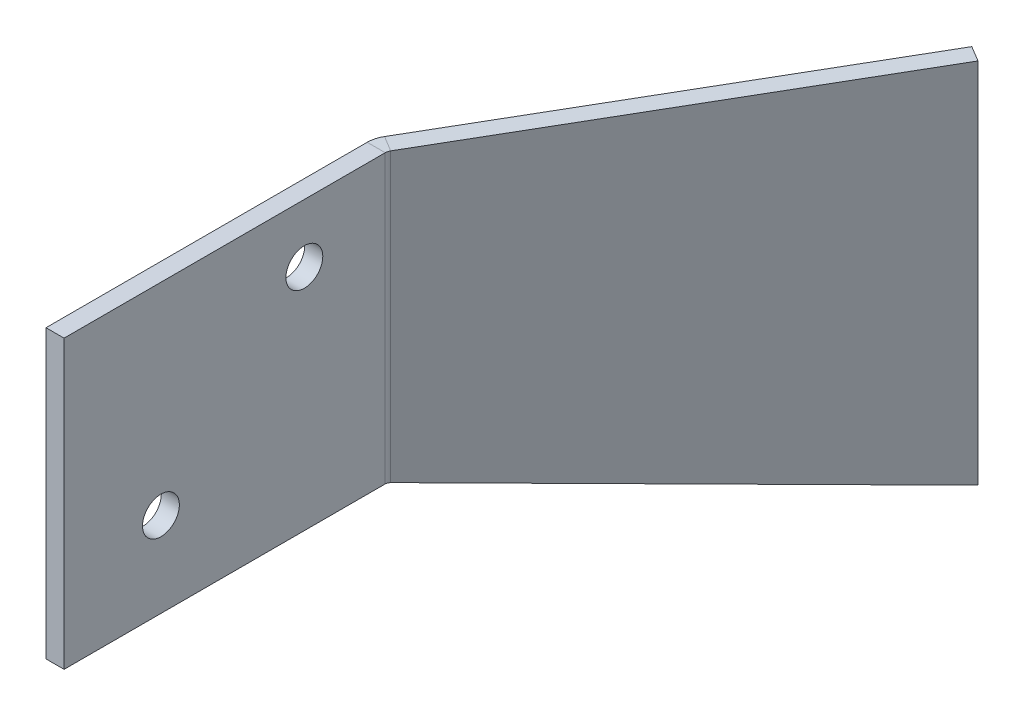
ISO-10303-21;
HEADER;
FILE_DESCRIPTION(('STEP AP214'),'2;1');
FILE_NAME('part.step','',(''),(''),'','','');
FILE_SCHEMA(('AUTOMOTIVE_DESIGN { 1 0 10303 214 1 1 1 1 }'));
ENDSEC;
DATA;
#1=APPLICATION_CONTEXT('core data for automotive mechanical design processes');
#2=APPLICATION_PROTOCOL_DEFINITION('international standard','automotive_design',2000,#1);
#3=PRODUCT_CONTEXT('',#1,'mechanical');
#4=PRODUCT('Part','Part','',(#3));
#5=PRODUCT_RELATED_PRODUCT_CATEGORY('part','',(#4));
#6=PRODUCT_DEFINITION_FORMATION('','',#4);
#7=PRODUCT_DEFINITION_CONTEXT('part definition',#1,'design');
#8=PRODUCT_DEFINITION('design','',#6,#7);
#9=PRODUCT_DEFINITION_SHAPE('','',#8);
#10=(LENGTH_UNIT() NAMED_UNIT(*) SI_UNIT(.MILLI.,.METRE.));
#11=(NAMED_UNIT(*) PLANE_ANGLE_UNIT() SI_UNIT($,.RADIAN.));
#12=(NAMED_UNIT(*) SI_UNIT($,.STERADIAN.) SOLID_ANGLE_UNIT());
#13=UNCERTAINTY_MEASURE_WITH_UNIT(LENGTH_MEASURE(1.E-05),#10,'distance_accuracy_value','');
#14=(GEOMETRIC_REPRESENTATION_CONTEXT(3) GLOBAL_UNCERTAINTY_ASSIGNED_CONTEXT((#13)) GLOBAL_UNIT_ASSIGNED_CONTEXT((#10,
#11,#12)) REPRESENTATION_CONTEXT('',''));
#15=CARTESIAN_POINT('',(0.,0.,0.));
#16=DIRECTION('',(0.,0.,1.));
#17=DIRECTION('',(1.,0.,0.));
#18=AXIS2_PLACEMENT_3D('',#15,#16,#17);
#19=CARTESIAN_POINT('',(-1.6002,-19.396714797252,15.875));
#20=DIRECTION('',(0.,0.,1.));
#21=DIRECTION('',(-1.,0.,0.));
#22=AXIS2_PLACEMENT_3D('',#19,#20,#21);
#23=PLANE('',#22);
#24=DIRECTION('',(0.,1.,0.));
#25=VECTOR('',#24,1.);
#26=CARTESIAN_POINT('',(-1.6002,-19.396714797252,15.875));
#27=LINE('',#26,#25);
#28=CARTESIAN_POINT('',(-1.6002,-19.396714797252,15.875));
#29=VERTEX_POINT('',#28);
#30=CARTESIAN_POINT('',(-1.6002,6.00328520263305,15.875));
#31=VERTEX_POINT('',#30);
#32=EDGE_CURVE('E197',#29,#31,#27,.T.);
#33=ORIENTED_EDGE('',*,*,#32,.F.);
#34=DIRECTION('',(1.,0.,0.));
#35=VECTOR('',#34,1.);
#36=CARTESIAN_POINT('',(-1.6002,-19.396714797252,15.875));
#37=LINE('',#36,#35);
#38=CARTESIAN_POINT('',(0.,-19.396714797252,15.875));
#39=VERTEX_POINT('',#38);
#40=EDGE_CURVE('E11',#29,#39,#37,.T.);
#41=ORIENTED_EDGE('',*,*,#40,.T.);
#42=DIRECTION('',(0.,1.,0.));
#43=VECTOR('',#42,1.);
#44=CARTESIAN_POINT('',(0.,-19.396714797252,15.875));
#45=LINE('',#44,#43);
#46=CARTESIAN_POINT('',(0.,6.00328520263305,15.875));
#47=VERTEX_POINT('',#46);
#48=EDGE_CURVE('E205',#39,#47,#45,.T.);
#49=ORIENTED_EDGE('',*,*,#48,.T.);
#50=DIRECTION('',(1.,0.,0.));
#51=VECTOR('',#50,1.);
#52=CARTESIAN_POINT('',(0.,6.00328520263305,15.875));
#53=LINE('',#52,#51);
#54=EDGE_CURVE('E200',#47,#31,#53,.F.);
#55=ORIENTED_EDGE('',*,*,#54,.T.);
#56=EDGE_LOOP('',(#33,#41,#49,#55));
#57=FACE_BOUND('',#56,.T.);
#58=ADVANCED_FACE('F41',(#57),#23,.T.);
#59=CARTESIAN_POINT('',(0.73660000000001,-19.4327343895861,-12.5637679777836));
#60=DIRECTION('',(0.,-1.,0.));
#61=DIRECTION('',(-0.857167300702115,0.,-0.515038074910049));
#62=AXIS2_PLACEMENT_3D('',#59,#60,#61);
#63=CYLINDRICAL_SURFACE('',#62,2.33679999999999);
#64=DIRECTION('',(0.,-1.,0.));
#65=VECTOR('',#64,1.);
#66=CARTESIAN_POINT('',(-1.26642854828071,19.396714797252,-13.7673089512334));
#67=LINE('',#66,#65);
#68=CARTESIAN_POINT('',(-1.2664285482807,-19.4327343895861,-13.7673089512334));
#69=VERTEX_POINT('',#68);
#70=CARTESIAN_POINT('',(-1.26642854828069,6.00810081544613,-13.7673089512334));
#71=VERTEX_POINT('',#70);
#72=EDGE_CURVE('E127',#69,#71,#67,.F.);
#73=ORIENTED_EDGE('',*,*,#72,.F.);
#74=CARTESIAN_POINT('',(-1.26642854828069,-19.4327343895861,-13.7673089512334));
#75=CARTESIAN_POINT('',(-1.27999492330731,-19.4319839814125,-13.7447310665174));
#76=CARTESIAN_POINT('',(-1.29317923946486,-19.4312335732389,-13.7219236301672));
#77=CARTESIAN_POINT('',(-1.31876938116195,-19.4297327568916,-13.6758761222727));
#78=CARTESIAN_POINT('',(-1.3311752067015,-19.428982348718,-13.6526360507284));
#79=CARTESIAN_POINT('',(-1.35519399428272,-19.4274815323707,-13.6057497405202));
#80=CARTESIAN_POINT('',(-1.3668069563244,-19.4267311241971,-13.5821035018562));
#81=CARTESIAN_POINT('',(-1.38922678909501,-19.4252303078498,-13.5344319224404));
#82=CARTESIAN_POINT('',(-1.40003365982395,-19.4244798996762,-13.5104065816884));
#83=CARTESIAN_POINT('',(-1.42082893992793,-19.422979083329,-13.4620042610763));
#84=CARTESIAN_POINT('',(-1.43081734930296,-19.4222286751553,-13.4376272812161));
#85=CARTESIAN_POINT('',(-1.44996428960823,-19.4207278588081,-13.3885495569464));
#86=CARTESIAN_POINT('',(-1.45912282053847,-19.4199774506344,-13.3638488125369));
#87=CARTESIAN_POINT('',(-1.47659953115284,-19.4184766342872,-13.3141518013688));
#88=CARTESIAN_POINT('',(-1.48491771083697,-19.4177262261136,-13.2891555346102));
#89=CARTESIAN_POINT('',(-1.500704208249,-19.4162254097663,-13.2388960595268));
#90=CARTESIAN_POINT('',(-1.50817252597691,-19.4154750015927,-13.2136328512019));
#91=CARTESIAN_POINT('',(-1.52225076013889,-19.4139741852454,-13.1628683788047));
#92=CARTESIAN_POINT('',(-1.52886067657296,-19.4132237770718,-13.1373671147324));
#93=CARTESIAN_POINT('',(-1.54121455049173,-19.4117229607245,-13.0861556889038));
#94=CARTESIAN_POINT('',(-1.54695850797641,-19.4109725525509,-13.0604455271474));
#95=CARTESIAN_POINT('',(-1.55757389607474,-19.4094717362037,-13.0088457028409));
#96=CARTESIAN_POINT('',(-1.56244532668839,-19.40872132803,-12.9829560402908));
#97=CARTESIAN_POINT('',(-1.57131009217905,-19.4072205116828,-12.9310268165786));
#98=CARTESIAN_POINT('',(-1.57530342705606,-19.4064701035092,-12.9049872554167));
#99=CARTESIAN_POINT('',(-1.58240743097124,-19.4049692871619,-12.8527880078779));
#100=CARTESIAN_POINT('',(-1.5855181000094,-19.4042188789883,-12.8266283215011));
#101=CARTESIAN_POINT('',(-1.5908532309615,-19.402718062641,-12.774218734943));
#102=CARTESIAN_POINT('',(-1.59307769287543,-19.4019676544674,-12.7479688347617));
#103=CARTESIAN_POINT('',(-1.59663780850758,-19.4004668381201,-12.6954088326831));
#104=CARTESIAN_POINT('',(-1.59797346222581,-19.3997164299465,-12.6690987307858));
#105=CARTESIAN_POINT('',(-1.59975464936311,-19.3982156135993,-12.6164484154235));
#106=CARTESIAN_POINT('',(-1.60020018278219,-19.3974652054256,-12.5901082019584));
#107=CARTESIAN_POINT('',(-1.60019999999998,-19.396714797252,-12.5637679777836));
#108=B_SPLINE_CURVE_WITH_KNOTS('',3,(#74,#75,#76,#77,#78,#79,#80,#81,#82,#83,#84,#85,#86,#87,
#88,#89,#90,#91,#92,#93,#94,#95,#96,#97,#98,#99,#100,#101,#102,#103,#104,#105,#106,#107),
.UNSPECIFIED.,.F.,.F.,(4,2,2,2,2,2,2,2,2,2,2,2,2,2,2,2,4),(0.,0.0790489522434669,
0.158097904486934,0.237146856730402,0.316195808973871,0.395244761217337,0.474293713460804,
0.553342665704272,0.632391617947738,0.711440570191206,0.790489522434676,0.86953847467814,
0.948587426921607,1.02763637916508,1.10668533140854,1.18573428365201,1.26478323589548),.UNSPECIFIED.);
#109=CARTESIAN_POINT('',(-1.60019999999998,-19.396714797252,-12.5637679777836));
#110=VERTEX_POINT('',#109);
#111=EDGE_CURVE('E146',#69,#110,#108,.T.);
#112=ORIENTED_EDGE('',*,*,#111,.T.);
#113=DIRECTION('',(0.,-1.,0.));
#114=VECTOR('',#113,1.);
#115=CARTESIAN_POINT('',(-1.60019999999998,-19.4327343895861,-12.5637679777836));
#116=LINE('',#115,#114);
#117=CARTESIAN_POINT('',(-1.6002,6.0032852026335,-12.5637679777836));
#118=VERTEX_POINT('',#117);
#119=EDGE_CURVE('E211',#110,#118,#116,.F.);
#120=ORIENTED_EDGE('',*,*,#119,.T.);
#121=CARTESIAN_POINT('',(-1.2664285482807,6.00810081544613,-13.7673089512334));
#122=CARTESIAN_POINT('',(-1.27999492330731,6.00800049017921,-13.7447310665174));
#123=CARTESIAN_POINT('',(-1.29317923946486,6.00790016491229,-13.7219236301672));
#124=CARTESIAN_POINT('',(-1.31876938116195,6.00769951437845,-13.6758761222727));
#125=CARTESIAN_POINT('',(-1.3311752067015,6.00759918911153,-13.6526360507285));
#126=CARTESIAN_POINT('',(-1.35519399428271,6.00739853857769,-13.6057497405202));
#127=CARTESIAN_POINT('',(-1.36680695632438,6.00729821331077,-13.5821035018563));
#128=CARTESIAN_POINT('',(-1.38922678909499,6.00709756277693,-13.5344319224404));
#129=CARTESIAN_POINT('',(-1.40003365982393,6.00699723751,-13.5104065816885));
#130=CARTESIAN_POINT('',(-1.42082893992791,6.00679658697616,-13.4620042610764));
#131=CARTESIAN_POINT('',(-1.43081734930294,6.00669626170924,-13.4376272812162));
#132=CARTESIAN_POINT('',(-1.44996428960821,6.0064956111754,-13.3885495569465));
#133=CARTESIAN_POINT('',(-1.45912282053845,6.00639528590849,-13.363848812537));
#134=CARTESIAN_POINT('',(-1.47659953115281,6.00619463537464,-13.3141518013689));
#135=CARTESIAN_POINT('',(-1.48491771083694,6.00609431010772,-13.2891555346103));
#136=CARTESIAN_POINT('',(-1.50070420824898,6.00589365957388,-13.2388960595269));
#137=CARTESIAN_POINT('',(-1.50817252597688,6.00579333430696,-13.213632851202));
#138=CARTESIAN_POINT('',(-1.52225076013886,6.00559268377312,-13.1628683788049));
#139=CARTESIAN_POINT('',(-1.52886067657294,6.0054923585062,-13.1373671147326));
#140=CARTESIAN_POINT('',(-1.5412145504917,6.00529170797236,-13.0861556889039));
#141=CARTESIAN_POINT('',(-1.54695850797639,6.00519138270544,-13.0604455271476));
#142=CARTESIAN_POINT('',(-1.55757389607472,6.0049907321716,-13.0088457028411));
#143=CARTESIAN_POINT('',(-1.56244532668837,6.00489040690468,-12.9829560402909));
#144=CARTESIAN_POINT('',(-1.57131009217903,6.00468975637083,-12.9310268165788));
#145=CARTESIAN_POINT('',(-1.57530342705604,6.00458943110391,-12.9049872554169));
#146=CARTESIAN_POINT('',(-1.58240743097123,6.00438878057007,-12.8527880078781));
#147=CARTESIAN_POINT('',(-1.58551810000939,6.00428845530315,-12.8266283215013));
#148=CARTESIAN_POINT('',(-1.59085323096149,6.00408780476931,-12.7742187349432));
#149=CARTESIAN_POINT('',(-1.59307769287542,6.00398747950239,-12.7479688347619));
#150=CARTESIAN_POINT('',(-1.59663780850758,6.00378682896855,-12.6954088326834));
#151=CARTESIAN_POINT('',(-1.59797346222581,6.00368650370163,-12.6690987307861));
#152=CARTESIAN_POINT('',(-1.59975464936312,6.00348585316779,-12.6164484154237));
#153=CARTESIAN_POINT('',(-1.6002001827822,6.00338552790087,-12.5901082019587));
#154=CARTESIAN_POINT('',(-1.6002,6.00328520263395,-12.5637679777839));
#155=B_SPLINE_CURVE_WITH_KNOTS('',3,(#121,#122,#123,#124,#125,#126,#127,#128,#129,#130,#131,
#132,#133,#134,#135,#136,#137,#138,#139,#140,#141,#142,#143,#144,#145,#146,#147,#148,#149,#150,
#151,#152,#153,#154),.UNSPECIFIED.,.F.,.F.,(4,2,2,2,2,2,2,2,2,2,2,2,2,2,2,2,4),(0.,
0.0790174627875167,0.158034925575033,0.237052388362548,0.316069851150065,0.395087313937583,
0.474104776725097,0.553122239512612,0.632139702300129,0.711157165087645,0.790174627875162,
0.869192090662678,0.948209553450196,1.02722701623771,1.10624447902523,1.18526194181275,
1.26427940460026),.UNSPECIFIED.);
#156=EDGE_CURVE('E227',#71,#118,#155,.T.);
#157=ORIENTED_EDGE('',*,*,#156,.F.);
#158=EDGE_LOOP('',(#73,#112,#120,#157));
#159=FACE_BOUND('',#158,.T.);
#160=ADVANCED_FACE('F160',(#159),#63,.T.);
#161=CARTESIAN_POINT('',(0.73660000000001,-19.4327343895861,-12.5637679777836));
#162=DIRECTION('',(0.,-1.,0.));
#163=DIRECTION('',(-0.857167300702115,0.,-0.515038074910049));
#164=AXIS2_PLACEMENT_3D('',#161,#162,#163);
#165=CYLINDRICAL_SURFACE('',#164,0.736599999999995);
#166=CARTESIAN_POINT('',(0.105210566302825,6.00810081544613,-12.9431450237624));
#167=CARTESIAN_POINT('',(0.100934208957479,6.00800049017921,-12.936028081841));
#168=CARTESIAN_POINT('',(0.0967782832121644,6.00790016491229,-12.9288387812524));
#169=CARTESIAN_POINT('',(0.0887118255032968,6.00769951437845,-12.9143238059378));
#170=CARTESIAN_POINT('',(0.0848012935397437,6.00759918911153,-12.9069981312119));
#171=CARTESIAN_POINT('',(0.077230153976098,6.00739853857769,-12.8922187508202));
#172=CARTESIAN_POINT('',(0.0735695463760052,6.00729821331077,-12.8847650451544));
#173=CARTESIAN_POINT('',(0.0665024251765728,6.00709756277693,-12.8697381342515));
#174=CARTESIAN_POINT('',(0.0630959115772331,6.00699723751,-12.8621649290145));
#175=CARTESIAN_POINT('',(0.0565408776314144,6.00679658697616,-12.8469076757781));
#176=CARTESIAN_POINT('',(0.0533923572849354,6.00669626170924,-12.8392236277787));
#177=CARTESIAN_POINT('',(0.0473569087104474,6.0064956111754,-12.8237534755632));
#178=CARTESIAN_POINT('',(0.0444699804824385,6.00639528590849,-12.8159673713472));
#179=CARTESIAN_POINT('',(0.0389610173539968,6.00619463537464,-12.8003020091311));
#180=CARTESIAN_POINT('',(0.036338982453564,6.00609431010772,-12.7924227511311));
#181=CARTESIAN_POINT('',(0.0313628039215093,6.00589365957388,-12.776580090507));
#182=CARTESIAN_POINT('',(0.0290086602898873,6.00579333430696,-12.7686166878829));
#183=CARTESIAN_POINT('',(0.0245709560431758,6.00559268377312,-12.7526148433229));
#184=CARTESIAN_POINT('',(0.0224873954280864,6.0054923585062,-12.7445764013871));
#185=CARTESIAN_POINT('',(0.0185932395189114,6.00529170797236,-12.7284336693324));
#186=CARTESIAN_POINT('',(0.0167826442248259,6.00519138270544,-12.7203293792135));
#187=CARTESIAN_POINT('',(0.0134364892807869,6.0049907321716,-12.7040642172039));
#188=CARTESIAN_POINT('',(0.0119009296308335,6.00489040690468,-12.6959033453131));
#189=CARTESIAN_POINT('',(0.00910660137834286,6.00468975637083,-12.6795343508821));
#190=CARTESIAN_POINT('',(0.00784783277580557,6.00458943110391,-12.6713262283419));
#191=CARTESIAN_POINT('',(0.00560852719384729,6.00438878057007,-12.6548721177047));
#192=CARTESIAN_POINT('',(0.0046279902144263,6.00428845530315,-12.6466261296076));
#193=CARTESIAN_POINT('',(0.00294626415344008,6.00408780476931,-12.6301057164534));
#194=CARTESIAN_POINT('',(0.00224507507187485,6.00398747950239,-12.6218312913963));
#195=CARTESIAN_POINT('',(0.00112286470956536,6.00378682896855,-12.6052634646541));
#196=CARTESIAN_POINT('',(0.000701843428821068,6.00368650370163,-12.5969700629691));
#197=CARTESIAN_POINT('',(0.000140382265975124,6.00348585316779,-12.5803737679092));
#198=CARTESIAN_POINT('',(-5.76161265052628E-08,6.00338552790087,-12.5720708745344));
#199=CARTESIAN_POINT('',(0.,6.00328520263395,-12.5637679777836));
#200=B_SPLINE_CURVE_WITH_KNOTS('',3,(#166,#167,#168,#169,#170,#171,#172,#173,#174,#175,#176,
#177,#178,#179,#180,#181,#182,#183,#184,#185,#186,#187,#188,#189,#190,#191,#192,#193,#194,#195,
#196,#197,#198,#199),.UNSPECIFIED.,.F.,.F.,(4,2,2,2,2,2,2,2,2,2,2,2,2,2,2,2,4),(0.,
0.0249093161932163,0.049818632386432,0.0747279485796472,0.0996372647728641,0.124546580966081,
0.149455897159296,0.174365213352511,0.199274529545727,0.224183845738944,0.249093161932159,
0.274002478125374,0.298911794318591,0.323821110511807,0.348730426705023,0.373639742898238,
0.398549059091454),.UNSPECIFIED.);
#201=CARTESIAN_POINT('',(0.105210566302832,6.00810081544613,-12.9431450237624));
#202=VERTEX_POINT('',#201);
#203=CARTESIAN_POINT('',(0.,6.00328520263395,-12.5637679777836));
#204=VERTEX_POINT('',#203);
#205=EDGE_CURVE('E225',#202,#204,#200,.T.);
#206=ORIENTED_EDGE('',*,*,#205,.T.);
#207=DIRECTION('',(0.,-1.,0.));
#208=VECTOR('',#207,1.);
#209=CARTESIAN_POINT('',(0.,-19.4327343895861,-12.5637679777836));
#210=LINE('',#209,#208);
#211=CARTESIAN_POINT('',(0.,-19.396714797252,-12.5637679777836));
#212=VERTEX_POINT('',#211);
#213=EDGE_CURVE('E144',#212,#204,#210,.F.);
#214=ORIENTED_EDGE('',*,*,#213,.F.);
#215=CARTESIAN_POINT('',(0.105210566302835,-19.4327343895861,-12.9431450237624));
#216=CARTESIAN_POINT('',(0.10093420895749,-19.4319839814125,-12.936028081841));
#217=CARTESIAN_POINT('',(0.0967782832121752,-19.4312335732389,-12.9288387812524));
#218=CARTESIAN_POINT('',(0.0887118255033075,-19.4297327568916,-12.9143238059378));
#219=CARTESIAN_POINT('',(0.0848012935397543,-19.428982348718,-12.9069981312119));
#220=CARTESIAN_POINT('',(0.0772301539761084,-19.4274815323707,-12.8922187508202));
#221=CARTESIAN_POINT('',(0.0735695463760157,-19.4267311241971,-12.8847650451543));
#222=CARTESIAN_POINT('',(0.0665024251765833,-19.4252303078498,-12.8697381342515));
#223=CARTESIAN_POINT('',(0.0630959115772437,-19.4244798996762,-12.8621649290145));
#224=CARTESIAN_POINT('',(0.0565408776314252,-19.422979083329,-12.8469076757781));
#225=CARTESIAN_POINT('',(0.0533923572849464,-19.4222286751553,-12.8392236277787));
#226=CARTESIAN_POINT('',(0.0473569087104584,-19.4207278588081,-12.8237534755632));
#227=CARTESIAN_POINT('',(0.0444699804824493,-19.4199774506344,-12.8159673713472));
#228=CARTESIAN_POINT('',(0.0389610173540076,-19.4184766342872,-12.8003020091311));
#229=CARTESIAN_POINT('',(0.036338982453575,-19.4177262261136,-12.7924227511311));
#230=CARTESIAN_POINT('',(0.0313628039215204,-19.4162254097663,-12.776580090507));
#231=CARTESIAN_POINT('',(0.0290086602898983,-19.4154750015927,-12.7686166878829));
#232=CARTESIAN_POINT('',(0.0245709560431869,-19.4139741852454,-12.7526148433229));
#233=CARTESIAN_POINT('',(0.0224873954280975,-19.4132237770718,-12.7445764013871));
#234=CARTESIAN_POINT('',(0.0185932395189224,-19.4117229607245,-12.7284336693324));
#235=CARTESIAN_POINT('',(0.0167826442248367,-19.4109725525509,-12.7203293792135));
#236=CARTESIAN_POINT('',(0.0134364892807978,-19.4094717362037,-12.7040642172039));
#237=CARTESIAN_POINT('',(0.0119009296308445,-19.40872132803,-12.6959033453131));
#238=CARTESIAN_POINT('',(0.00910660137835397,-19.4072205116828,-12.6795343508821));
#239=CARTESIAN_POINT('',(0.00784783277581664,-19.4064701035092,-12.6713262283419));
#240=CARTESIAN_POINT('',(0.00560852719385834,-19.4049692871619,-12.6548721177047));
#241=CARTESIAN_POINT('',(0.00462799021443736,-19.4042188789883,-12.6466261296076));
#242=CARTESIAN_POINT('',(0.00294626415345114,-19.402718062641,-12.6301057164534));
#243=CARTESIAN_POINT('',(0.00224507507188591,-19.4019676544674,-12.6218312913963));
#244=CARTESIAN_POINT('',(0.00112286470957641,-19.4004668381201,-12.6052634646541));
#245=CARTESIAN_POINT('',(0.000701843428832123,-19.3997164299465,-12.5969700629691));
#246=CARTESIAN_POINT('',(0.000140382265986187,-19.3982156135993,-12.5803737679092));
#247=CARTESIAN_POINT('',(-5.76161154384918E-08,-19.3974652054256,-12.5720708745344));
#248=CARTESIAN_POINT('',(0.,-19.396714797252,-12.5637679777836));
#249=B_SPLINE_CURVE_WITH_KNOTS('',3,(#215,#216,#217,#218,#219,#220,#221,#222,#223,#224,#225,
#226,#227,#228,#229,#230,#231,#232,#233,#234,#235,#236,#237,#238,#239,#240,#241,#242,#243,#244,
#245,#246,#247,#248),.UNSPECIFIED.,.F.,.F.,(4,2,2,2,2,2,2,2,2,2,2,2,2,2,2,2,4),(0.,
0.0250090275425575,0.0500180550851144,0.0750270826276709,0.100036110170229,0.125045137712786,
0.150054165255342,0.175063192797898,0.200072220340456,0.225081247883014,0.25009027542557,
0.275099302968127,0.300108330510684,0.325117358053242,0.350126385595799,0.375135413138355,
0.400144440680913),.UNSPECIFIED.);
#250=CARTESIAN_POINT('',(0.105210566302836,-19.4327343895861,-12.9431450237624));
#251=VERTEX_POINT('',#250);
#252=EDGE_CURVE('E139',#251,#212,#249,.T.);
#253=ORIENTED_EDGE('',*,*,#252,.F.);
#254=DIRECTION('',(0.,-1.,0.));
#255=VECTOR('',#254,1.);
#256=CARTESIAN_POINT('',(0.105210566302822,19.396714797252,-12.9431450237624));
#257=LINE('',#256,#255);
#258=EDGE_CURVE('E136',#202,#251,#257,.T.);
#259=ORIENTED_EDGE('',*,*,#258,.F.);
#260=EDGE_LOOP('',(#206,#214,#253,#259));
#261=FACE_BOUND('',#260,.T.);
#262=ADVANCED_FACE('F150',(#261),#165,.F.);
#263=CARTESIAN_POINT('',(-8.38003563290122,0.,-1.92827863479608));
#264=DIRECTION('',(0.857167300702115,0.,0.515038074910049));
#265=DIRECTION('',(-0.515038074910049,0.,0.857167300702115));
#266=AXIS2_PLACEMENT_3D('',#263,#264,#265);
#267=PLANE('',#266);
#268=DIRECTION('',(-0.515007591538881,-0.0108797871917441,0.857116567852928));
#269=VECTOR('',#268,1.);
#270=CARTESIAN_POINT('',(-8.41285802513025,5.85712899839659,-1.87365300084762));
#271=LINE('',#270,#269);
#272=CARTESIAN_POINT('',(18.2513115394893,6.4204226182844,-46.2502833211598));
#273=VERTEX_POINT('',#272);
#274=EDGE_CURVE('E114',#273,#71,#271,.T.);
#275=ORIENTED_EDGE('',*,*,#274,.F.);
#276=DIRECTION('',(0.,1.,0.));
#277=VECTOR('',#276,1.);
#278=CARTESIAN_POINT('',(18.2513115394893,-26.1147727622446,-46.2502833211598));
#279=LINE('',#278,#277);
#280=CARTESIAN_POINT('',(18.2513115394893,-26.1147727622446,-46.2502833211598));
#281=VERTEX_POINT('',#280);
#282=EDGE_CURVE('E111',#273,#281,#279,.F.);
#283=ORIENTED_EDGE('',*,*,#282,.T.);
#284=DIRECTION('',(0.507213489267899,-0.173648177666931,-0.84414500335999));
#285=VECTOR('',#284,1.);
#286=CARTESIAN_POINT('',(-1.37163911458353,-19.396714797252,-13.5922091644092));
#287=LINE('',#286,#285);
#288=EDGE_CURVE('E269',#281,#69,#287,.F.);
#289=ORIENTED_EDGE('',*,*,#288,.T.);
#290=ORIENTED_EDGE('',*,*,#72,.T.);
#291=EDGE_LOOP('',(#275,#283,#289,#290));
#292=FACE_BOUND('',#291,.T.);
#293=ADVANCED_FACE('F159',(#292),#267,.F.);
#294=CARTESIAN_POINT('',(-7.00839651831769,0.,-1.10411470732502));
#295=DIRECTION('',(0.857167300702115,0.,0.515038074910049));
#296=DIRECTION('',(-0.515038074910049,0.,0.857167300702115));
#297=AXIS2_PLACEMENT_3D('',#294,#295,#296);
#298=PLANE('',#297);
#299=ORIENTED_EDGE('',*,*,#258,.T.);
#300=DIRECTION('',(-0.507213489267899,0.173648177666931,0.84414500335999));
#301=VECTOR('',#300,1.);
#302=CARTESIAN_POINT('',(-8.50546609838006,-16.4848074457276,1.38742747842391));
#303=LINE('',#302,#301);
#304=CARTESIAN_POINT('',(19.6229506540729,-26.1147727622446,-45.4261193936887));
#305=VERTEX_POINT('',#304);
#306=EDGE_CURVE('E126',#305,#251,#303,.T.);
#307=ORIENTED_EDGE('',*,*,#306,.F.);
#308=DIRECTION('',(0.,-1.,0.));
#309=VECTOR('',#308,1.);
#310=CARTESIAN_POINT('',(19.6229506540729,0.,-45.4261193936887));
#311=LINE('',#310,#309);
#312=CARTESIAN_POINT('',(19.6229506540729,6.4204226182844,-45.4261193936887));
#313=VERTEX_POINT('',#312);
#314=EDGE_CURVE('E108',#313,#305,#311,.T.);
#315=ORIENTED_EDGE('',*,*,#314,.F.);
#316=DIRECTION('',(-0.515007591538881,-0.0108797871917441,0.857116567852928));
#317=VECTOR('',#316,1.);
#318=CARTESIAN_POINT('',(-7.04121891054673,5.85712899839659,-1.04948907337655));
#319=LINE('',#318,#317);
#320=EDGE_CURVE('E117',#313,#202,#319,.T.);
#321=ORIENTED_EDGE('',*,*,#320,.T.);
#322=EDGE_LOOP('',(#299,#307,#315,#321));
#323=FACE_BOUND('',#322,.T.);
#324=ADVANCED_FACE('F124',(#323),#298,.T.);
#325=CARTESIAN_POINT('',(18.2513115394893,-26.1147727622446,-46.2502833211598));
#326=DIRECTION('',(0.515038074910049,0.,-0.857167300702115));
#327=DIRECTION('',(0.857167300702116,0.,0.515038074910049));
#328=AXIS2_PLACEMENT_3D('',#325,#326,#327);
#329=PLANE('',#328);
#330=ORIENTED_EDGE('',*,*,#314,.T.);
#331=DIRECTION('',(0.857167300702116,0.,0.515038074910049));
#332=VECTOR('',#331,1.);
#333=CARTESIAN_POINT('',(18.2513115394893,-26.1147727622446,-46.2502833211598));
#334=LINE('',#333,#332);
#335=EDGE_CURVE('E145',#281,#305,#334,.T.);
#336=ORIENTED_EDGE('',*,*,#335,.F.);
#337=ORIENTED_EDGE('',*,*,#282,.F.);
#338=DIRECTION('',(0.857167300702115,0.,0.515038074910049));
#339=VECTOR('',#338,1.);
#340=CARTESIAN_POINT('',(19.6229506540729,6.42042261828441,-45.4261193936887));
#341=LINE('',#340,#339);
#342=EDGE_CURVE('E55',#313,#273,#341,.F.);
#343=ORIENTED_EDGE('',*,*,#342,.F.);
#344=EDGE_LOOP('',(#330,#336,#337,#343));
#345=FACE_BOUND('',#344,.T.);
#346=ADVANCED_FACE('F106',(#345),#329,.T.);
#347=CARTESIAN_POINT('',(-1.6002,-19.396714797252,-15.875));
#348=DIRECTION('',(0.,-1.,0.));
#349=DIRECTION('',(0.,0.,1.));
#350=AXIS2_PLACEMENT_3D('',#347,#348,#349);
#351=PLANE('',#350);
#352=DIRECTION('',(0.,0.,1.));
#353=VECTOR('',#352,1.);
#354=CARTESIAN_POINT('',(0.,-19.396714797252,-15.875));
#355=LINE('',#354,#353);
#356=EDGE_CURVE('E202',#212,#39,#355,.T.);
#357=ORIENTED_EDGE('',*,*,#356,.T.);
#358=ORIENTED_EDGE('',*,*,#40,.F.);
#359=DIRECTION('',(0.,0.,1.));
#360=VECTOR('',#359,1.);
#361=CARTESIAN_POINT('',(-1.6002,-19.396714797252,-15.875));
#362=LINE('',#361,#360);
#363=EDGE_CURVE('E48',#110,#29,#362,.T.);
#364=ORIENTED_EDGE('',*,*,#363,.F.);
#365=DIRECTION('',(-1.,0.,0.));
#366=VECTOR('',#365,1.);
#367=CARTESIAN_POINT('',(0.,-19.396714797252,-12.5637679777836));
#368=LINE('',#367,#366);
#369=EDGE_CURVE('E207',#212,#110,#368,.T.);
#370=ORIENTED_EDGE('',*,*,#369,.F.);
#371=EDGE_LOOP('',(#357,#358,#364,#370));
#372=FACE_BOUND('',#371,.T.);
#373=ADVANCED_FACE('F180',(#372),#351,.T.);
#374=CARTESIAN_POINT('',(-1.6002,0.,0.));
#375=DIRECTION('',(-1.,0.,0.));
#376=DIRECTION('',(0.,0.,-1.));
#377=AXIS2_PLACEMENT_3D('',#374,#375,#376);
#378=PLANE('',#377);
#379=CARTESIAN_POINT('',(-1.6002,-11.878314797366,7.29926602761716));
#380=DIRECTION('',(1.,0.,0.));
#381=DIRECTION('',(0.,0.,-1.));
#382=AXIS2_PLACEMENT_3D('',#379,#380,#381);
#383=CIRCLE('',#382,1.63194999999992);
#384=CARTESIAN_POINT('',(-1.6002,-11.878314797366,5.66731602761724));
#385=VERTEX_POINT('',#384);
#386=EDGE_CURVE('E232',#385,#385,#383,.T.);
#387=ORIENTED_EDGE('',*,*,#386,.T.);
#388=EDGE_LOOP('',(#387));
#389=FACE_BOUND('',#388,.T.);
#390=CARTESIAN_POINT('',(-1.6002,0.82168520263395,-5.40073397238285));
#391=DIRECTION('',(1.,0.,0.));
#392=DIRECTION('',(0.,0.,-1.));
#393=AXIS2_PLACEMENT_3D('',#390,#391,#392);
#394=CIRCLE('',#393,1.63194999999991);
#395=CARTESIAN_POINT('',(-1.6002,0.82168520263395,-7.03268397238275));
#396=VERTEX_POINT('',#395);
#397=EDGE_CURVE('E273',#396,#396,#394,.T.);
#398=ORIENTED_EDGE('',*,*,#397,.T.);
#399=EDGE_LOOP('',(#398));
#400=FACE_BOUND('',#399,.T.);
#401=ORIENTED_EDGE('',*,*,#119,.F.);
#402=ORIENTED_EDGE('',*,*,#363,.T.);
#403=ORIENTED_EDGE('',*,*,#32,.T.);
#404=DIRECTION('',(0.,0.,-1.));
#405=VECTOR('',#404,1.);
#406=CARTESIAN_POINT('',(-1.6002,6.00328520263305,0.));
#407=LINE('',#406,#405);
#408=EDGE_CURVE('E228',#31,#118,#407,.T.);
#409=ORIENTED_EDGE('',*,*,#408,.T.);
#410=EDGE_LOOP('',(#401,#402,#403,#409));
#411=FACE_BOUND('',#410,.T.);
#412=ADVANCED_FACE('F172',(#389,#400,#411),#378,.T.);
#413=CARTESIAN_POINT('',(0.,0.,0.));
#414=DIRECTION('',(-1.,0.,0.));
#415=DIRECTION('',(0.,0.,-1.));
#416=AXIS2_PLACEMENT_3D('',#413,#414,#415);
#417=PLANE('',#416);
#418=DIRECTION('',(0.,0.,-1.));
#419=VECTOR('',#418,1.);
#420=CARTESIAN_POINT('',(0.,6.00328520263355,1.90419665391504E-13));
#421=LINE('',#420,#419);
#422=EDGE_CURVE('E222',#47,#204,#421,.T.);
#423=ORIENTED_EDGE('',*,*,#422,.F.);
#424=ORIENTED_EDGE('',*,*,#48,.F.);
#425=ORIENTED_EDGE('',*,*,#356,.F.);
#426=ORIENTED_EDGE('',*,*,#213,.T.);
#427=EDGE_LOOP('',(#423,#424,#425,#426));
#428=FACE_BOUND('',#427,.T.);
#429=CARTESIAN_POINT('',(0.,-11.878314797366,7.29926602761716));
#430=DIRECTION('',(1.,0.,0.));
#431=DIRECTION('',(0.,0.,1.));
#432=AXIS2_PLACEMENT_3D('',#429,#430,#431);
#433=CIRCLE('',#432,1.63194999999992);
#434=CARTESIAN_POINT('',(0.,-11.878314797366,8.93121602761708));
#435=VERTEX_POINT('',#434);
#436=EDGE_CURVE('E276',#435,#435,#433,.T.);
#437=ORIENTED_EDGE('',*,*,#436,.F.);
#438=EDGE_LOOP('',(#437));
#439=FACE_BOUND('',#438,.T.);
#440=CARTESIAN_POINT('',(0.,0.82168520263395,-5.40073397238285));
#441=DIRECTION('',(1.,0.,0.));
#442=DIRECTION('',(0.,0.,1.));
#443=AXIS2_PLACEMENT_3D('',#440,#441,#442);
#444=CIRCLE('',#443,1.63194999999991);
#445=CARTESIAN_POINT('',(0.,0.82168520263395,-7.03268397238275));
#446=VERTEX_POINT('',#445);
#447=EDGE_CURVE('E138',#446,#446,#444,.T.);
#448=ORIENTED_EDGE('',*,*,#447,.F.);
#449=EDGE_LOOP('',(#448));
#450=FACE_BOUND('',#449,.T.);
#451=ADVANCED_FACE('F170',(#428,#439,#450),#417,.F.);
#452=CARTESIAN_POINT('',(-1.28014493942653,-19.4327343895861,-13.7755505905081));
#453=CARTESIAN_POINT('',(-1.499085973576,-19.4207061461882,-13.4111715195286));
#454=CARTESIAN_POINT('',(-1.61620199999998,-19.4087430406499,-12.9888647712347));
#455=CARTESIAN_POINT('',(-1.61620199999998,-19.396714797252,-12.5637679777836));
#456=CARTESIAN_POINT('',(-1.26642854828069,-19.4327343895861,-13.7673089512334));
#457=CARTESIAN_POINT('',(-1.48388050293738,-19.4207061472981,-13.4054081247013));
#458=CARTESIAN_POINT('',(-1.60019999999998,-19.40874303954,-12.9859735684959));
#459=CARTESIAN_POINT('',(-1.60019999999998,-19.396714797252,-12.5637679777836));
#460=CARTESIAN_POINT('',(0.105210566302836,-19.4327343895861,-12.9431450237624));
#461=CARTESIAN_POINT('',(0.036666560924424,-19.42070625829,-12.829068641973));
#462=CARTESIAN_POINT('',(0.,-19.4087429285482,-12.6968532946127));
#463=CARTESIAN_POINT('',(0.,-19.396714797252,-12.5637679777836));
#464=B_SPLINE_SURFACE_WITH_KNOTS('',1,3,((#452,#453,#454,#455),(#456,#457,#458,#459),(#460,#461,
#462,#463)),.UNSPECIFIED.,.F.,.F.,.F.,(2,1,2),(4,4),(-0.01,0.,1.),(0.,1.),.UNSPECIFIED.);
#465=DIRECTION('',(-0.857167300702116,0.,-0.515038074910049));
#466=VECTOR('',#465,1.);
#467=CARTESIAN_POINT('',(0.105210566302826,-19.4327343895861,-12.9431450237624));
#468=LINE('',#467,#466);
#469=EDGE_CURVE('E131',#251,#69,#468,.T.);
#470=ORIENTED_EDGE('',*,*,#252,.T.);
#471=ORIENTED_EDGE('',*,*,#369,.T.);
#472=ORIENTED_EDGE('',*,*,#111,.F.);
#473=ORIENTED_EDGE('',*,*,#469,.F.);
#474=EDGE_LOOP('',(#470,#471,#472,#473));
#475=FACE_BOUND('',#474,.T.);
#476=ADVANCED_FACE('F164',(#475),#464,.T.);
#477=CARTESIAN_POINT('',(-1.37163911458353,-19.396714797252,-13.5922091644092));
#478=DIRECTION('',(-0.0894354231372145,-0.984807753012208,0.148845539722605));
#479=DIRECTION('',(0.,0.14944441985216,0.988770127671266));
#480=AXIS2_PLACEMENT_3D('',#477,#478,#479);
#481=PLANE('',#480);
#482=ORIENTED_EDGE('',*,*,#288,.F.);
#483=ORIENTED_EDGE('',*,*,#335,.T.);
#484=ORIENTED_EDGE('',*,*,#306,.T.);
#485=ORIENTED_EDGE('',*,*,#469,.T.);
#486=EDGE_LOOP('',(#482,#483,#484,#485));
#487=FACE_BOUND('',#486,.T.);
#488=ADVANCED_FACE('F169',(#487),#481,.T.);
#489=CARTESIAN_POINT('',(-1.28014493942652,6.00810081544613,-13.7755505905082));
#490=CARTESIAN_POINT('',(-1.49908618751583,6.00649270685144,-13.4111711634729));
#491=CARTESIAN_POINT('',(-1.616202,6.00489331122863,-12.9888651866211));
#492=CARTESIAN_POINT('',(-1.616202,6.00328520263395,-12.5637679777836));
#493=CARTESIAN_POINT('',(-1.26642854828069,6.00810081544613,-13.7673089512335));
#494=CARTESIAN_POINT('',(-1.48388072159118,6.00649270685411,-13.4054077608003));
#495=CARTESIAN_POINT('',(-1.6002,6.00489331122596,-12.985973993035));
#496=CARTESIAN_POINT('',(-1.6002,6.00328520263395,-12.5637679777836));
#497=CARTESIAN_POINT('',(0.105210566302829,6.00810081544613,-12.9431450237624));
#498=CARTESIAN_POINT('',(0.0366658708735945,6.00649270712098,-12.8290674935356));
#499=CARTESIAN_POINT('',(0.,6.00489331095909,-12.6968546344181));
#500=CARTESIAN_POINT('',(0.,6.00328520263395,-12.5637679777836));
#501=B_SPLINE_SURFACE_WITH_KNOTS('',1,3,((#489,#490,#491,#492),(#493,#494,#495,#496),(#497,#498,
#499,#500)),.UNSPECIFIED.,.F.,.F.,.F.,(2,1,2),(4,4),(-0.01,0.,1.),(0.,1.),.UNSPECIFIED.);
#502=DIRECTION('',(0.857167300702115,0.,0.515038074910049));
#503=VECTOR('',#502,1.);
#504=CARTESIAN_POINT('',(0.105210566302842,6.00810081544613,-12.9431450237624));
#505=LINE('',#504,#503);
#506=EDGE_CURVE('E119',#202,#71,#505,.F.);
#507=DIRECTION('',(-1.,0.,0.));
#508=VECTOR('',#507,1.);
#509=CARTESIAN_POINT('',(0.,6.00328520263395,-12.5637679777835));
#510=LINE('',#509,#508);
#511=EDGE_CURVE('E113',#118,#204,#510,.F.);
#512=ORIENTED_EDGE('',*,*,#506,.T.);
#513=ORIENTED_EDGE('',*,*,#156,.T.);
#514=ORIENTED_EDGE('',*,*,#511,.T.);
#515=ORIENTED_EDGE('',*,*,#205,.F.);
#516=EDGE_LOOP('',(#512,#513,#514,#515));
#517=FACE_BOUND('',#516,.T.);
#518=ADVANCED_FACE('F261',(#517),#501,.F.);
#519=CARTESIAN_POINT('',(0.,6.00328520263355,1.90419665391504E-13));
#520=DIRECTION('',(0.,-1.,0.));
#521=DIRECTION('',(0.,0.,-1.));
#522=AXIS2_PLACEMENT_3D('',#519,#520,#521);
#523=PLANE('',#522);
#524=ORIENTED_EDGE('',*,*,#511,.F.);
#525=ORIENTED_EDGE('',*,*,#408,.F.);
#526=ORIENTED_EDGE('',*,*,#54,.F.);
#527=ORIENTED_EDGE('',*,*,#422,.T.);
#528=EDGE_LOOP('',(#524,#525,#526,#527));
#529=FACE_BOUND('',#528,.T.);
#530=ADVANCED_FACE('F266',(#529),#523,.F.);
#531=CARTESIAN_POINT('',(-7.04121891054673,5.85712899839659,-1.04948907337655));
#532=DIRECTION('',(0.00560350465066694,-0.999940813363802,-0.0093257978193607));
#533=DIRECTION('',(-0.515007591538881,-0.0108797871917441,0.857116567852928));
#534=AXIS2_PLACEMENT_3D('',#531,#532,#533);
#535=PLANE('',#534);
#536=ORIENTED_EDGE('',*,*,#320,.F.);
#537=ORIENTED_EDGE('',*,*,#342,.T.);
#538=ORIENTED_EDGE('',*,*,#274,.T.);
#539=ORIENTED_EDGE('',*,*,#506,.F.);
#540=EDGE_LOOP('',(#536,#537,#538,#539));
#541=FACE_BOUND('',#540,.T.);
#542=ADVANCED_FACE('F118',(#541),#535,.F.);
#543=CARTESIAN_POINT('',(0.,0.82168520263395,-5.40073397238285));
#544=DIRECTION('',(-1.,0.,0.));
#545=DIRECTION('',(0.,0.,-1.));
#546=AXIS2_PLACEMENT_3D('',#543,#544,#545);
#547=CYLINDRICAL_SURFACE('',#546,1.63194999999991);
#548=CARTESIAN_POINT('',(0.,0.82168520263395,-7.03268397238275));
#549=CARTESIAN_POINT('',(-0.01666875,0.82168520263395,-7.03268397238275));
#550=CARTESIAN_POINT('',(-0.0333375,0.82168520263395,-7.03268397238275));
#551=CARTESIAN_POINT('',(-0.066675,0.82168520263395,-7.03268397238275));
#552=CARTESIAN_POINT('',(-0.08334375,0.82168520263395,-7.03268397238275));
#553=CARTESIAN_POINT('',(-0.11668125,0.82168520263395,-7.03268397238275));
#554=CARTESIAN_POINT('',(-0.13335,0.82168520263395,-7.03268397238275));
#555=CARTESIAN_POINT('',(-0.1666875,0.82168520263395,-7.03268397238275));
#556=CARTESIAN_POINT('',(-0.18335625,0.82168520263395,-7.03268397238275));
#557=CARTESIAN_POINT('',(-0.21669375,0.82168520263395,-7.03268397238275));
#558=CARTESIAN_POINT('',(-0.2333625,0.82168520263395,-7.03268397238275));
#559=CARTESIAN_POINT('',(-0.2667,0.82168520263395,-7.03268397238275));
#560=CARTESIAN_POINT('',(-0.28336875,0.82168520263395,-7.03268397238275));
#561=CARTESIAN_POINT('',(-0.31670625,0.82168520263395,-7.03268397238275));
#562=CARTESIAN_POINT('',(-0.333375,0.82168520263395,-7.03268397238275));
#563=CARTESIAN_POINT('',(-0.3667125,0.82168520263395,-7.03268397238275));
#564=CARTESIAN_POINT('',(-0.38338125,0.82168520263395,-7.03268397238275));
#565=CARTESIAN_POINT('',(-0.41671875,0.82168520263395,-7.03268397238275));
#566=CARTESIAN_POINT('',(-0.4333875,0.82168520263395,-7.03268397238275));
#567=CARTESIAN_POINT('',(-0.466725,0.82168520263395,-7.03268397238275));
#568=CARTESIAN_POINT('',(-0.48339375,0.82168520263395,-7.03268397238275));
#569=CARTESIAN_POINT('',(-0.51673125,0.82168520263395,-7.03268397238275));
#570=CARTESIAN_POINT('',(-0.5334,0.82168520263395,-7.03268397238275));
#571=CARTESIAN_POINT('',(-0.5667375,0.82168520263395,-7.03268397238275));
#572=CARTESIAN_POINT('',(-0.58340625,0.82168520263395,-7.03268397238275));
#573=CARTESIAN_POINT('',(-0.61674375,0.82168520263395,-7.03268397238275));
#574=CARTESIAN_POINT('',(-0.6334125,0.82168520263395,-7.03268397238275));
#575=CARTESIAN_POINT('',(-0.66675,0.82168520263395,-7.03268397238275));
#576=CARTESIAN_POINT('',(-0.68341875,0.82168520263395,-7.03268397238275));
#577=CARTESIAN_POINT('',(-0.71675625,0.82168520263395,-7.03268397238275));
#578=CARTESIAN_POINT('',(-0.733425,0.82168520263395,-7.03268397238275));
#579=CARTESIAN_POINT('',(-0.7667625,0.82168520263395,-7.03268397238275));
#580=CARTESIAN_POINT('',(-0.78343125,0.82168520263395,-7.03268397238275));
#581=CARTESIAN_POINT('',(-0.81676875,0.82168520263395,-7.03268397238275));
#582=CARTESIAN_POINT('',(-0.8334375,0.82168520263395,-7.03268397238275));
#583=CARTESIAN_POINT('',(-0.866775,0.82168520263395,-7.03268397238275));
#584=CARTESIAN_POINT('',(-0.88344375,0.82168520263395,-7.03268397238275));
#585=CARTESIAN_POINT('',(-0.91678125,0.82168520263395,-7.03268397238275));
#586=CARTESIAN_POINT('',(-0.93345,0.82168520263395,-7.03268397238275));
#587=CARTESIAN_POINT('',(-0.9667875,0.82168520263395,-7.03268397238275));
#588=CARTESIAN_POINT('',(-0.98345625,0.82168520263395,-7.03268397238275));
#589=CARTESIAN_POINT('',(-1.01679375,0.82168520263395,-7.03268397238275));
#590=CARTESIAN_POINT('',(-1.0334625,0.82168520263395,-7.03268397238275));
#591=CARTESIAN_POINT('',(-1.0668,0.82168520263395,-7.03268397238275));
#592=CARTESIAN_POINT('',(-1.08346875,0.82168520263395,-7.03268397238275));
#593=CARTESIAN_POINT('',(-1.11680625,0.82168520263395,-7.03268397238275));
#594=CARTESIAN_POINT('',(-1.133475,0.82168520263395,-7.03268397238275));
#595=CARTESIAN_POINT('',(-1.1668125,0.82168520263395,-7.03268397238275));
#596=CARTESIAN_POINT('',(-1.18348125,0.82168520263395,-7.03268397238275));
#597=CARTESIAN_POINT('',(-1.21681875,0.82168520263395,-7.03268397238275));
#598=CARTESIAN_POINT('',(-1.2334875,0.82168520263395,-7.03268397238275));
#599=CARTESIAN_POINT('',(-1.266825,0.82168520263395,-7.03268397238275));
#600=CARTESIAN_POINT('',(-1.28349375,0.82168520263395,-7.03268397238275));
#601=CARTESIAN_POINT('',(-1.31683125,0.82168520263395,-7.03268397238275));
#602=CARTESIAN_POINT('',(-1.3335,0.82168520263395,-7.03268397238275));
#603=CARTESIAN_POINT('',(-1.3668375,0.82168520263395,-7.03268397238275));
#604=CARTESIAN_POINT('',(-1.38350625,0.82168520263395,-7.03268397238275));
#605=CARTESIAN_POINT('',(-1.41684375,0.82168520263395,-7.03268397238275));
#606=CARTESIAN_POINT('',(-1.4335125,0.82168520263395,-7.03268397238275));
#607=CARTESIAN_POINT('',(-1.46685,0.82168520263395,-7.03268397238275));
#608=CARTESIAN_POINT('',(-1.48351875,0.82168520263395,-7.03268397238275));
#609=CARTESIAN_POINT('',(-1.51685625,0.82168520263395,-7.03268397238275));
#610=CARTESIAN_POINT('',(-1.533525,0.82168520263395,-7.03268397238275));
#611=CARTESIAN_POINT('',(-1.5668625,0.82168520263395,-7.03268397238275));
#612=CARTESIAN_POINT('',(-1.58353125,0.82168520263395,-7.03268397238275));
#613=CARTESIAN_POINT('',(-1.6002,0.82168520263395,-7.03268397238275));
#614=B_SPLINE_CURVE_WITH_KNOTS('',3,(#548,#549,#550,#551,#552,#553,#554,#555,#556,#557,#558,
#559,#560,#561,#562,#563,#564,#565,#566,#567,#568,#569,#570,#571,#572,#573,#574,#575,#576,#577,
#578,#579,#580,#581,#582,#583,#584,#585,#586,#587,#588,#589,#590,#591,#592,#593,#594,#595,#596,
#597,#598,#599,#600,#601,#602,#603,#604,#605,#606,#607,#608,#609,#610,#611,#612,#613),
.UNSPECIFIED.,.F.,.F.,(4,2,2,2,2,2,2,2,2,2,2,2,2,2,2,2,2,2,2,2,2,2,2,2,2,2,2,2,2,2,2,2,4),(0.,
0.05000625,0.1000125,0.15001875,0.200025,0.25003125,0.3000375,0.35004375,0.40005,0.45005625,
0.5000625,0.55006875,0.600075,0.65008125,0.7000875,0.75009375,0.8001,0.85010625,0.9001125,
0.95011875,1.000125,1.05013125,1.1001375,1.15014375,1.20015,1.25015625,1.3001625,1.35016875,
1.400175,1.45018125,1.5001875,1.55019375,1.6002),.UNSPECIFIED.);
#615=EDGE_CURVE('BSEAM250',#446,#396,#614,.T.);
#616=ORIENTED_EDGE('',*,*,#447,.T.);
#617=ORIENTED_EDGE('',*,*,#397,.F.);
#618=ORIENTED_EDGE('',*,*,#615,.T.);
#619=ORIENTED_EDGE('',*,*,#615,.F.);
#620=EDGE_LOOP('',(#616,#618,#617,#619));
#621=FACE_BOUND('',#620,.T.);
#622=ADVANCED_FACE('F250',(#621),#547,.F.);
#623=CARTESIAN_POINT('',(0.,-11.878314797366,7.29926602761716));
#624=DIRECTION('',(-1.,0.,0.));
#625=DIRECTION('',(0.,0.,-1.));
#626=AXIS2_PLACEMENT_3D('',#623,#624,#625);
#627=CYLINDRICAL_SURFACE('',#626,1.63194999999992);
#628=ORIENTED_EDGE('',*,*,#436,.T.);
#629=EDGE_LOOP('',(#628));
#630=FACE_BOUND('',#629,.T.);
#631=ORIENTED_EDGE('',*,*,#386,.F.);
#632=EDGE_LOOP('',(#631));
#633=FACE_BOUND('',#632,.T.);
#634=ADVANCED_FACE('F253',(#630,#633),#627,.F.);
#635=CLOSED_SHELL('',(#58,#160,#262,#293,#324,#346,#373,#412,#451,#476,#488,#518,#530,#542,#622,#634));
#636=MANIFOLD_SOLID_BREP('B2',#635);
#637=ADVANCED_BREP_SHAPE_REPRESENTATION('',(#18,#636),#14);
#638=SHAPE_DEFINITION_REPRESENTATION(#9,#637);
ENDSEC;
END-ISO-10303-21;
